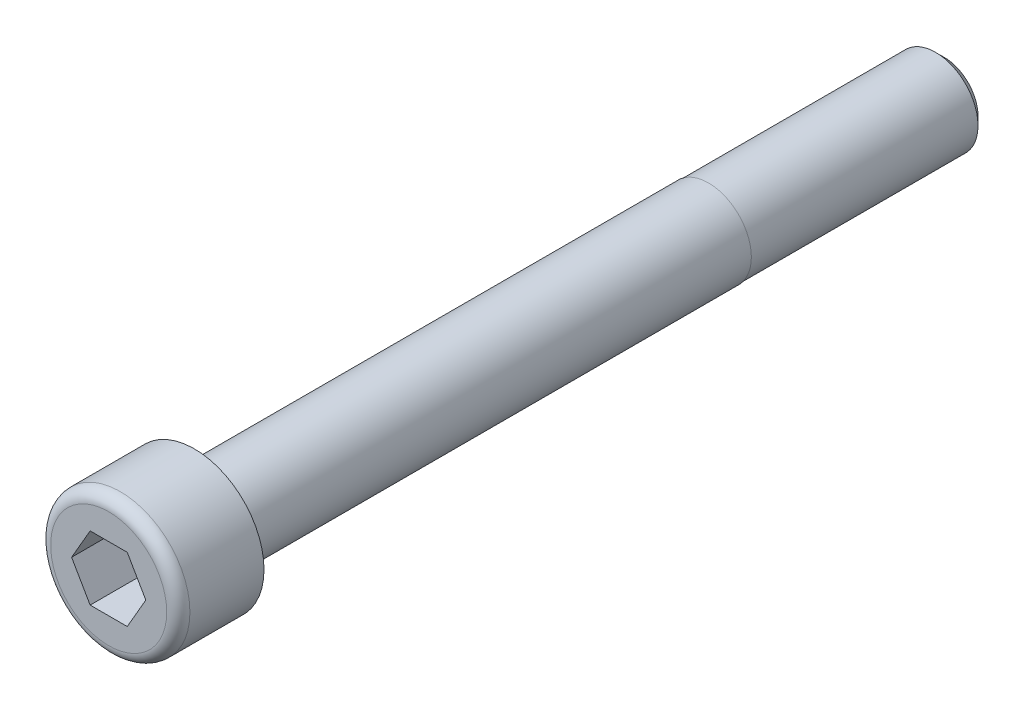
ISO-10303-21;
HEADER;
FILE_DESCRIPTION(('STEP AP214'),'2;1');
FILE_NAME('part.step','',(''),(''),'','','');
FILE_SCHEMA(('AUTOMOTIVE_DESIGN { 1 0 10303 214 1 1 1 1 }'));
ENDSEC;
DATA;
#1=APPLICATION_CONTEXT('core data for automotive mechanical design processes');
#2=APPLICATION_PROTOCOL_DEFINITION('international standard','automotive_design',2000,#1);
#3=PRODUCT_CONTEXT('',#1,'mechanical');
#4=PRODUCT('Part','Part','',(#3));
#5=PRODUCT_RELATED_PRODUCT_CATEGORY('part','',(#4));
#6=PRODUCT_DEFINITION_FORMATION('','',#4);
#7=PRODUCT_DEFINITION_CONTEXT('part definition',#1,'design');
#8=PRODUCT_DEFINITION('design','',#6,#7);
#9=PRODUCT_DEFINITION_SHAPE('','',#8);
#10=(LENGTH_UNIT() NAMED_UNIT(*) SI_UNIT(.MILLI.,.METRE.));
#11=(NAMED_UNIT(*) PLANE_ANGLE_UNIT() SI_UNIT($,.RADIAN.));
#12=(NAMED_UNIT(*) SI_UNIT($,.STERADIAN.) SOLID_ANGLE_UNIT());
#13=UNCERTAINTY_MEASURE_WITH_UNIT(LENGTH_MEASURE(1.E-05),#10,'distance_accuracy_value','');
#14=(GEOMETRIC_REPRESENTATION_CONTEXT(3) GLOBAL_UNCERTAINTY_ASSIGNED_CONTEXT((#13)) GLOBAL_UNIT_ASSIGNED_CONTEXT((#10,
#11,#12)) REPRESENTATION_CONTEXT('',''));
#15=CARTESIAN_POINT('',(0.,0.,0.));
#16=DIRECTION('',(0.,0.,1.));
#17=DIRECTION('',(1.,0.,0.));
#18=AXIS2_PLACEMENT_3D('',#15,#16,#17);
#19=CARTESIAN_POINT('',(0.,0.,-48.));
#20=DIRECTION('',(0.,0.,-1.));
#21=DIRECTION('',(-1.,0.,0.));
#22=AXIS2_PLACEMENT_3D('',#19,#20,#21);
#23=PLANE('',#22);
#24=CARTESIAN_POINT('',(0.,0.,-48.));
#25=DIRECTION('',(0.,0.,-1.));
#26=DIRECTION('',(-1.,0.,0.));
#27=AXIS2_PLACEMENT_3D('',#24,#25,#26);
#28=CIRCLE('',#27,4.);
#29=CARTESIAN_POINT('',(-4.,0.,-48.));
#30=VERTEX_POINT('',#29);
#31=EDGE_CURVE('E135',#30,#30,#28,.T.);
#32=ORIENTED_EDGE('',*,*,#31,.T.);
#33=EDGE_LOOP('',(#32));
#34=FACE_BOUND('',#33,.T.);
#35=CARTESIAN_POINT('',(0.,0.,-48.));
#36=DIRECTION('',(0.,0.,-1.));
#37=DIRECTION('',(-1.,0.,0.));
#38=AXIS2_PLACEMENT_3D('',#35,#36,#37);
#39=CIRCLE('',#38,3.95);
#40=CARTESIAN_POINT('',(-3.95,0.,-48.));
#41=VERTEX_POINT('',#40);
#42=EDGE_CURVE('E122',#41,#41,#39,.T.);
#43=ORIENTED_EDGE('',*,*,#42,.F.);
#44=EDGE_LOOP('',(#43));
#45=FACE_BOUND('',#44,.T.);
#46=ADVANCED_FACE('F32',(#34,#45),#23,.T.);
#47=CARTESIAN_POINT('',(0.,0.,0.));
#48=DIRECTION('',(0.,0.,1.));
#49=DIRECTION('',(1.,0.,0.));
#50=AXIS2_PLACEMENT_3D('',#47,#48,#49);
#51=PLANE('',#50);
#52=CARTESIAN_POINT('',(0.,0.,0.));
#53=DIRECTION('',(0.,0.,1.));
#54=DIRECTION('',(1.,0.,0.));
#55=AXIS2_PLACEMENT_3D('',#52,#53,#54);
#56=CIRCLE('',#55,6.5);
#57=CARTESIAN_POINT('',(6.5,0.,0.));
#58=VERTEX_POINT('',#57);
#59=EDGE_CURVE('E143',#58,#58,#56,.T.);
#60=ORIENTED_EDGE('',*,*,#59,.F.);
#61=EDGE_LOOP('',(#60));
#62=FACE_BOUND('',#61,.T.);
#63=CARTESIAN_POINT('',(0.,0.,0.));
#64=DIRECTION('',(0.,0.,1.));
#65=DIRECTION('',(1.,0.,0.));
#66=AXIS2_PLACEMENT_3D('',#63,#64,#65);
#67=CIRCLE('',#66,4.);
#68=CARTESIAN_POINT('',(4.,0.,0.));
#69=VERTEX_POINT('',#68);
#70=EDGE_CURVE('E146',#69,#69,#67,.F.);
#71=ORIENTED_EDGE('',*,*,#70,.F.);
#72=EDGE_LOOP('',(#71));
#73=FACE_BOUND('',#72,.T.);
#74=ADVANCED_FACE('F170',(#62,#73),#51,.F.);
#75=CARTESIAN_POINT('',(0.,0.,8.));
#76=DIRECTION('',(0.,0.,-1.));
#77=DIRECTION('',(-1.,0.,0.));
#78=AXIS2_PLACEMENT_3D('',#75,#76,#77);
#79=CYLINDRICAL_SURFACE('',#78,6.5);
#80=CARTESIAN_POINT('',(0.,0.,6.91666666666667));
#81=DIRECTION('',(0.,0.,1.));
#82=DIRECTION('',(1.,0.,0.));
#83=AXIS2_PLACEMENT_3D('',#80,#81,#82);
#84=CIRCLE('',#83,6.5);
#85=CARTESIAN_POINT('',(6.5,0.,6.91666666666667));
#86=VERTEX_POINT('',#85);
#87=EDGE_CURVE('E11',#86,#86,#84,.F.);
#88=ORIENTED_EDGE('',*,*,#87,.T.);
#89=EDGE_LOOP('',(#88));
#90=FACE_BOUND('',#89,.T.);
#91=ORIENTED_EDGE('',*,*,#59,.T.);
#92=EDGE_LOOP('',(#91));
#93=FACE_BOUND('',#92,.T.);
#94=ADVANCED_FACE('F176',(#90,#93),#79,.T.);
#95=CARTESIAN_POINT('',(0.,0.,8.));
#96=DIRECTION('',(0.,0.,1.));
#97=DIRECTION('',(1.,0.,0.));
#98=AXIS2_PLACEMENT_3D('',#95,#96,#97);
#99=PLANE('',#98);
#100=CARTESIAN_POINT('',(0.,0.,8.));
#101=DIRECTION('',(0.,0.,1.));
#102=DIRECTION('',(1.,0.,0.));
#103=AXIS2_PLACEMENT_3D('',#100,#101,#102);
#104=CIRCLE('',#103,5.41666666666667);
#105=CARTESIAN_POINT('',(5.41666666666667,0.,8.));
#106=VERTEX_POINT('',#105);
#107=EDGE_CURVE('E40',#106,#106,#104,.T.);
#108=ORIENTED_EDGE('',*,*,#107,.T.);
#109=EDGE_LOOP('',(#108));
#110=FACE_BOUND('',#109,.T.);
#111=DIRECTION('',(0.500000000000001,0.866025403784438,0.));
#112=VECTOR('',#111,1.);
#113=CARTESIAN_POINT('',(1.73205080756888,-2.99999999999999,8.));
#114=LINE('',#113,#112);
#115=CARTESIAN_POINT('',(1.73205080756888,-2.99999999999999,8.));
#116=VERTEX_POINT('',#115);
#117=CARTESIAN_POINT('',(3.46410161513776,0.,8.));
#118=VERTEX_POINT('',#117);
#119=EDGE_CURVE('E47',#116,#118,#114,.T.);
#120=ORIENTED_EDGE('',*,*,#119,.F.);
#121=DIRECTION('',(1.,0.,0.));
#122=VECTOR('',#121,1.);
#123=CARTESIAN_POINT('',(-1.73205080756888,-2.99999999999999,8.));
#124=LINE('',#123,#122);
#125=CARTESIAN_POINT('',(-1.73205080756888,-2.99999999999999,8.));
#126=VERTEX_POINT('',#125);
#127=EDGE_CURVE('E131',#126,#116,#124,.T.);
#128=ORIENTED_EDGE('',*,*,#127,.F.);
#129=DIRECTION('',(0.500000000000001,-0.866025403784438,0.));
#130=VECTOR('',#129,1.);
#131=CARTESIAN_POINT('',(-3.46410161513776,0.,8.));
#132=LINE('',#131,#130);
#133=CARTESIAN_POINT('',(-3.46410161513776,0.,8.));
#134=VERTEX_POINT('',#133);
#135=EDGE_CURVE('E129',#134,#126,#132,.T.);
#136=ORIENTED_EDGE('',*,*,#135,.F.);
#137=DIRECTION('',(-0.500000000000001,-0.866025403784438,0.));
#138=VECTOR('',#137,1.);
#139=CARTESIAN_POINT('',(-1.73205080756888,3.,8.));
#140=LINE('',#139,#138);
#141=CARTESIAN_POINT('',(-1.73205080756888,3.,8.));
#142=VERTEX_POINT('',#141);
#143=EDGE_CURVE('E95',#142,#134,#140,.T.);
#144=ORIENTED_EDGE('',*,*,#143,.F.);
#145=DIRECTION('',(-1.,0.,0.));
#146=VECTOR('',#145,1.);
#147=CARTESIAN_POINT('',(1.73205080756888,3.,8.));
#148=LINE('',#147,#146);
#149=CARTESIAN_POINT('',(1.73205080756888,3.,8.));
#150=VERTEX_POINT('',#149);
#151=EDGE_CURVE('E125',#150,#142,#148,.T.);
#152=ORIENTED_EDGE('',*,*,#151,.F.);
#153=DIRECTION('',(-0.500000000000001,0.866025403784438,0.));
#154=VECTOR('',#153,1.);
#155=CARTESIAN_POINT('',(3.46410161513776,0.,8.));
#156=LINE('',#155,#154);
#157=EDGE_CURVE('E121',#118,#150,#156,.T.);
#158=ORIENTED_EDGE('',*,*,#157,.F.);
#159=EDGE_LOOP('',(#120,#128,#136,#144,#152,#158));
#160=FACE_BOUND('',#159,.T.);
#161=ADVANCED_FACE('F157',(#110,#160),#99,.T.);
#162=CARTESIAN_POINT('',(0.,0.,-48.));
#163=DIRECTION('',(0.,0.,1.));
#164=DIRECTION('',(1.,0.,0.));
#165=AXIS2_PLACEMENT_3D('',#162,#163,#164);
#166=CYLINDRICAL_SURFACE('',#165,4.);
#167=ORIENTED_EDGE('',*,*,#31,.F.);
#168=EDGE_LOOP('',(#167));
#169=FACE_BOUND('',#168,.T.);
#170=ORIENTED_EDGE('',*,*,#70,.T.);
#171=EDGE_LOOP('',(#170));
#172=FACE_BOUND('',#171,.T.);
#173=ADVANCED_FACE('F184',(#169,#172),#166,.T.);
#174=CARTESIAN_POINT('',(1.73205080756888,-2.99999999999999,0.));
#175=DIRECTION('',(0.866025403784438,-0.500000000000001,0.));
#176=DIRECTION('',(0.500000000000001,0.866025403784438,0.));
#177=AXIS2_PLACEMENT_3D('',#174,#175,#176);
#178=PLANE('',#177);
#179=ORIENTED_EDGE('',*,*,#119,.T.);
#180=DIRECTION('',(0.,0.,1.));
#181=VECTOR('',#180,1.);
#182=CARTESIAN_POINT('',(3.46410161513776,0.,0.));
#183=LINE('',#182,#181);
#184=CARTESIAN_POINT('',(3.46410161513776,0.,0.));
#185=VERTEX_POINT('',#184);
#186=EDGE_CURVE('E77',#185,#118,#183,.T.);
#187=ORIENTED_EDGE('',*,*,#186,.F.);
#188=DIRECTION('',(0.500000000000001,0.866025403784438,0.));
#189=VECTOR('',#188,1.);
#190=CARTESIAN_POINT('',(1.73205080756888,-2.99999999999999,0.));
#191=LINE('',#190,#189);
#192=CARTESIAN_POINT('',(1.73205080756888,-2.99999999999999,0.));
#193=VERTEX_POINT('',#192);
#194=EDGE_CURVE('E133',#193,#185,#191,.T.);
#195=ORIENTED_EDGE('',*,*,#194,.F.);
#196=DIRECTION('',(0.,0.,1.));
#197=VECTOR('',#196,1.);
#198=CARTESIAN_POINT('',(1.73205080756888,-2.99999999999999,0.));
#199=LINE('',#198,#197);
#200=EDGE_CURVE('E55',#193,#116,#199,.T.);
#201=ORIENTED_EDGE('',*,*,#200,.T.);
#202=EDGE_LOOP('',(#179,#187,#195,#201));
#203=FACE_BOUND('',#202,.T.);
#204=ADVANCED_FACE('F182',(#203),#178,.F.);
#205=CARTESIAN_POINT('',(-1.73205080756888,-2.99999999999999,0.));
#206=DIRECTION('',(0.,-1.,0.));
#207=DIRECTION('',(0.,0.,-1.));
#208=AXIS2_PLACEMENT_3D('',#205,#206,#207);
#209=PLANE('',#208);
#210=ORIENTED_EDGE('',*,*,#127,.T.);
#211=ORIENTED_EDGE('',*,*,#200,.F.);
#212=DIRECTION('',(1.,0.,0.));
#213=VECTOR('',#212,1.);
#214=CARTESIAN_POINT('',(-1.73205080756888,-2.99999999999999,0.));
#215=LINE('',#214,#213);
#216=CARTESIAN_POINT('',(-1.73205080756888,-2.99999999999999,0.));
#217=VERTEX_POINT('',#216);
#218=EDGE_CURVE('E107',#217,#193,#215,.T.);
#219=ORIENTED_EDGE('',*,*,#218,.F.);
#220=DIRECTION('',(0.,0.,1.));
#221=VECTOR('',#220,1.);
#222=CARTESIAN_POINT('',(-1.73205080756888,-2.99999999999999,0.));
#223=LINE('',#222,#221);
#224=EDGE_CURVE('E99',#217,#126,#223,.T.);
#225=ORIENTED_EDGE('',*,*,#224,.T.);
#226=EDGE_LOOP('',(#210,#211,#219,#225));
#227=FACE_BOUND('',#226,.T.);
#228=ADVANCED_FACE('F216',(#227),#209,.F.);
#229=CARTESIAN_POINT('',(-3.46410161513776,0.,0.));
#230=DIRECTION('',(-0.866025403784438,-0.500000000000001,0.));
#231=DIRECTION('',(0.500000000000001,-0.866025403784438,0.));
#232=AXIS2_PLACEMENT_3D('',#229,#230,#231);
#233=PLANE('',#232);
#234=ORIENTED_EDGE('',*,*,#135,.T.);
#235=ORIENTED_EDGE('',*,*,#224,.F.);
#236=DIRECTION('',(0.500000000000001,-0.866025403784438,0.));
#237=VECTOR('',#236,1.);
#238=CARTESIAN_POINT('',(-3.46410161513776,0.,0.));
#239=LINE('',#238,#237);
#240=CARTESIAN_POINT('',(-3.46410161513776,0.,0.));
#241=VERTEX_POINT('',#240);
#242=EDGE_CURVE('E103',#241,#217,#239,.T.);
#243=ORIENTED_EDGE('',*,*,#242,.F.);
#244=DIRECTION('',(0.,0.,1.));
#245=VECTOR('',#244,1.);
#246=CARTESIAN_POINT('',(-3.46410161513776,0.,0.));
#247=LINE('',#246,#245);
#248=EDGE_CURVE('E88',#241,#134,#247,.T.);
#249=ORIENTED_EDGE('',*,*,#248,.T.);
#250=EDGE_LOOP('',(#234,#235,#243,#249));
#251=FACE_BOUND('',#250,.T.);
#252=ADVANCED_FACE('F104',(#251),#233,.F.);
#253=CARTESIAN_POINT('',(-1.73205080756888,3.,0.));
#254=DIRECTION('',(-0.866025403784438,0.500000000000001,0.));
#255=DIRECTION('',(-0.500000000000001,-0.866025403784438,0.));
#256=AXIS2_PLACEMENT_3D('',#253,#254,#255);
#257=PLANE('',#256);
#258=ORIENTED_EDGE('',*,*,#143,.T.);
#259=ORIENTED_EDGE('',*,*,#248,.F.);
#260=DIRECTION('',(-0.500000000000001,-0.866025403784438,0.));
#261=VECTOR('',#260,1.);
#262=CARTESIAN_POINT('',(-1.73205080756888,3.,0.));
#263=LINE('',#262,#261);
#264=CARTESIAN_POINT('',(-1.73205080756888,3.,0.));
#265=VERTEX_POINT('',#264);
#266=EDGE_CURVE('E92',#265,#241,#263,.T.);
#267=ORIENTED_EDGE('',*,*,#266,.F.);
#268=DIRECTION('',(0.,0.,1.));
#269=VECTOR('',#268,1.);
#270=CARTESIAN_POINT('',(-1.73205080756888,3.,0.));
#271=LINE('',#270,#269);
#272=EDGE_CURVE('E100',#265,#142,#271,.T.);
#273=ORIENTED_EDGE('',*,*,#272,.T.);
#274=EDGE_LOOP('',(#258,#259,#267,#273));
#275=FACE_BOUND('',#274,.T.);
#276=ADVANCED_FACE('F90',(#275),#257,.F.);
#277=CARTESIAN_POINT('',(1.73205080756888,3.,0.));
#278=DIRECTION('',(0.,1.,0.));
#279=DIRECTION('',(0.,0.,1.));
#280=AXIS2_PLACEMENT_3D('',#277,#278,#279);
#281=PLANE('',#280);
#282=ORIENTED_EDGE('',*,*,#151,.T.);
#283=ORIENTED_EDGE('',*,*,#272,.F.);
#284=DIRECTION('',(-1.,0.,0.));
#285=VECTOR('',#284,1.);
#286=CARTESIAN_POINT('',(1.73205080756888,3.,0.));
#287=LINE('',#286,#285);
#288=CARTESIAN_POINT('',(1.73205080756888,3.,0.));
#289=VERTEX_POINT('',#288);
#290=EDGE_CURVE('E113',#289,#265,#287,.T.);
#291=ORIENTED_EDGE('',*,*,#290,.F.);
#292=DIRECTION('',(0.,0.,1.));
#293=VECTOR('',#292,1.);
#294=CARTESIAN_POINT('',(1.73205080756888,3.,0.));
#295=LINE('',#294,#293);
#296=EDGE_CURVE('E138',#289,#150,#295,.T.);
#297=ORIENTED_EDGE('',*,*,#296,.T.);
#298=EDGE_LOOP('',(#282,#283,#291,#297));
#299=FACE_BOUND('',#298,.T.);
#300=ADVANCED_FACE('F234',(#299),#281,.F.);
#301=CARTESIAN_POINT('',(3.46410161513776,0.,0.));
#302=DIRECTION('',(0.866025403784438,0.500000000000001,0.));
#303=DIRECTION('',(-0.500000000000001,0.866025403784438,0.));
#304=AXIS2_PLACEMENT_3D('',#301,#302,#303);
#305=PLANE('',#304);
#306=ORIENTED_EDGE('',*,*,#157,.T.);
#307=ORIENTED_EDGE('',*,*,#296,.F.);
#308=DIRECTION('',(-0.500000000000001,0.866025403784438,0.));
#309=VECTOR('',#308,1.);
#310=CARTESIAN_POINT('',(3.46410161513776,0.,0.));
#311=LINE('',#310,#309);
#312=EDGE_CURVE('E115',#185,#289,#311,.T.);
#313=ORIENTED_EDGE('',*,*,#312,.F.);
#314=ORIENTED_EDGE('',*,*,#186,.T.);
#315=EDGE_LOOP('',(#306,#307,#313,#314));
#316=FACE_BOUND('',#315,.T.);
#317=ADVANCED_FACE('F241',(#316),#305,.F.);
#318=CARTESIAN_POINT('',(3.46410161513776,0.,0.));
#319=DIRECTION('',(0.,0.,1.));
#320=DIRECTION('',(1.,0.,0.));
#321=AXIS2_PLACEMENT_3D('',#318,#319,#320);
#322=PLANE('',#321);
#323=ORIENTED_EDGE('',*,*,#194,.T.);
#324=ORIENTED_EDGE('',*,*,#312,.T.);
#325=ORIENTED_EDGE('',*,*,#290,.T.);
#326=ORIENTED_EDGE('',*,*,#266,.T.);
#327=ORIENTED_EDGE('',*,*,#242,.T.);
#328=ORIENTED_EDGE('',*,*,#218,.T.);
#329=EDGE_LOOP('',(#323,#324,#325,#326,#327,#328));
#330=FACE_BOUND('',#329,.T.);
#331=ADVANCED_FACE('F110',(#330),#322,.T.);
#332=CARTESIAN_POINT('',(0.,0.,-70.));
#333=DIRECTION('',(0.,0.,1.));
#334=DIRECTION('',(1.,0.,0.));
#335=AXIS2_PLACEMENT_3D('',#332,#333,#334);
#336=CYLINDRICAL_SURFACE('',#335,3.95);
#337=CARTESIAN_POINT('',(0.,0.,-69.21));
#338=DIRECTION('',(0.,0.,-1.));
#339=DIRECTION('',(-1.,0.,0.));
#340=AXIS2_PLACEMENT_3D('',#337,#338,#339);
#341=CIRCLE('',#340,3.95);
#342=CARTESIAN_POINT('',(3.95000000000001,0.,-69.21));
#343=VERTEX_POINT('',#342);
#344=EDGE_CURVE('E152',#343,#343,#341,.F.);
#345=ORIENTED_EDGE('',*,*,#344,.T.);
#346=EDGE_LOOP('',(#345));
#347=FACE_BOUND('',#346,.T.);
#348=ORIENTED_EDGE('',*,*,#42,.T.);
#349=EDGE_LOOP('',(#348));
#350=FACE_BOUND('',#349,.T.);
#351=ADVANCED_FACE('F255',(#347,#350),#336,.T.);
#352=CARTESIAN_POINT('',(0.,0.,-70.));
#353=DIRECTION('',(0.,0.,-1.));
#354=DIRECTION('',(-1.,0.,0.));
#355=AXIS2_PLACEMENT_3D('',#352,#353,#354);
#356=PLANE('',#355);
#357=CARTESIAN_POINT('',(0.,0.,-70.));
#358=DIRECTION('',(0.,0.,-1.));
#359=DIRECTION('',(-1.,0.,0.));
#360=AXIS2_PLACEMENT_3D('',#357,#358,#359);
#361=CIRCLE('',#360,3.15999999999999);
#362=CARTESIAN_POINT('',(3.15999999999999,0.,-70.));
#363=VERTEX_POINT('',#362);
#364=EDGE_CURVE('E149',#363,#363,#361,.T.);
#365=ORIENTED_EDGE('',*,*,#364,.T.);
#366=EDGE_LOOP('',(#365));
#367=FACE_BOUND('',#366,.T.);
#368=ADVANCED_FACE('F166',(#367),#356,.T.);
#369=CARTESIAN_POINT('',(0.,0.,-70.));
#370=DIRECTION('',(0.,0.,1.));
#371=DIRECTION('',(1.,0.,0.));
#372=AXIS2_PLACEMENT_3D('',#369,#370,#371);
#373=CONICAL_SURFACE('',#372,3.15999999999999,0.785398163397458);
#374=CARTESIAN_POINT('',(3.95000000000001,0.,-69.21));
#375=CARTESIAN_POINT('',(3.94177083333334,0.,-69.2182291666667));
#376=CARTESIAN_POINT('',(3.93354166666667,0.,-69.2264583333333));
#377=CARTESIAN_POINT('',(3.91708333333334,0.,-69.2429166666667));
#378=CARTESIAN_POINT('',(3.90885416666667,0.,-69.2511458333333));
#379=CARTESIAN_POINT('',(3.89239583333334,0.,-69.2676041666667));
#380=CARTESIAN_POINT('',(3.88416666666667,0.,-69.2758333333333));
#381=CARTESIAN_POINT('',(3.86770833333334,0.,-69.2922916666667));
#382=CARTESIAN_POINT('',(3.85947916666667,0.,-69.3005208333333));
#383=CARTESIAN_POINT('',(3.84302083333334,0.,-69.3169791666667));
#384=CARTESIAN_POINT('',(3.83479166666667,0.,-69.3252083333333));
#385=CARTESIAN_POINT('',(3.81833333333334,0.,-69.3416666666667));
#386=CARTESIAN_POINT('',(3.81010416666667,0.,-69.3498958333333));
#387=CARTESIAN_POINT('',(3.79364583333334,0.,-69.3663541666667));
#388=CARTESIAN_POINT('',(3.78541666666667,0.,-69.3745833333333));
#389=CARTESIAN_POINT('',(3.76895833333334,0.,-69.3910416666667));
#390=CARTESIAN_POINT('',(3.76072916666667,0.,-69.3992708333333));
#391=CARTESIAN_POINT('',(3.74427083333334,0.,-69.4157291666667));
#392=CARTESIAN_POINT('',(3.73604166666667,0.,-69.4239583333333));
#393=CARTESIAN_POINT('',(3.71958333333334,0.,-69.4404166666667));
#394=CARTESIAN_POINT('',(3.71135416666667,0.,-69.4486458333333));
#395=CARTESIAN_POINT('',(3.69489583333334,0.,-69.4651041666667));
#396=CARTESIAN_POINT('',(3.68666666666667,0.,-69.4733333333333));
#397=CARTESIAN_POINT('',(3.67020833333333,0.,-69.4897916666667));
#398=CARTESIAN_POINT('',(3.66197916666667,0.,-69.4980208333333));
#399=CARTESIAN_POINT('',(3.64552083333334,0.,-69.5144791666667));
#400=CARTESIAN_POINT('',(3.63729166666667,0.,-69.5227083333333));
#401=CARTESIAN_POINT('',(3.62083333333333,0.,-69.5391666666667));
#402=CARTESIAN_POINT('',(3.61260416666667,0.,-69.5473958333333));
#403=CARTESIAN_POINT('',(3.59614583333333,0.,-69.5638541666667));
#404=CARTESIAN_POINT('',(3.58791666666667,0.,-69.5720833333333));
#405=CARTESIAN_POINT('',(3.57145833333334,0.,-69.5885416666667));
#406=CARTESIAN_POINT('',(3.56322916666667,0.,-69.5967708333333));
#407=CARTESIAN_POINT('',(3.54677083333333,0.,-69.6132291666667));
#408=CARTESIAN_POINT('',(3.53854166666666,0.,-69.6214583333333));
#409=CARTESIAN_POINT('',(3.52208333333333,0.,-69.6379166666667));
#410=CARTESIAN_POINT('',(3.51385416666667,0.,-69.6461458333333));
#411=CARTESIAN_POINT('',(3.49739583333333,0.,-69.6626041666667));
#412=CARTESIAN_POINT('',(3.48916666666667,0.,-69.6708333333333));
#413=CARTESIAN_POINT('',(3.47270833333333,0.,-69.6872916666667));
#414=CARTESIAN_POINT('',(3.46447916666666,0.,-69.6955208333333));
#415=CARTESIAN_POINT('',(3.44802083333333,0.,-69.7119791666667));
#416=CARTESIAN_POINT('',(3.43979166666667,0.,-69.7202083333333));
#417=CARTESIAN_POINT('',(3.42333333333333,0.,-69.7366666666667));
#418=CARTESIAN_POINT('',(3.41510416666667,0.,-69.7448958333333));
#419=CARTESIAN_POINT('',(3.39864583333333,0.,-69.7613541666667));
#420=CARTESIAN_POINT('',(3.39041666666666,0.,-69.7695833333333));
#421=CARTESIAN_POINT('',(3.37395833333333,0.,-69.7860416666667));
#422=CARTESIAN_POINT('',(3.36572916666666,0.,-69.7942708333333));
#423=CARTESIAN_POINT('',(3.34927083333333,0.,-69.8107291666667));
#424=CARTESIAN_POINT('',(3.34104166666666,0.,-69.8189583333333));
#425=CARTESIAN_POINT('',(3.32458333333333,0.,-69.8354166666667));
#426=CARTESIAN_POINT('',(3.31635416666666,0.,-69.8436458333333));
#427=CARTESIAN_POINT('',(3.29989583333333,0.,-69.8601041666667));
#428=CARTESIAN_POINT('',(3.29166666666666,0.,-69.8683333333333));
#429=CARTESIAN_POINT('',(3.27520833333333,0.,-69.8847916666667));
#430=CARTESIAN_POINT('',(3.26697916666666,0.,-69.8930208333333));
#431=CARTESIAN_POINT('',(3.25052083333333,0.,-69.9094791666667));
#432=CARTESIAN_POINT('',(3.24229166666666,0.,-69.9177083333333));
#433=CARTESIAN_POINT('',(3.22583333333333,0.,-69.9341666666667));
#434=CARTESIAN_POINT('',(3.21760416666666,0.,-69.9423958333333));
#435=CARTESIAN_POINT('',(3.20114583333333,0.,-69.9588541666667));
#436=CARTESIAN_POINT('',(3.19291666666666,0.,-69.9670833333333));
#437=CARTESIAN_POINT('',(3.17645833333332,0.,-69.9835416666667));
#438=CARTESIAN_POINT('',(3.16822916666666,0.,-69.9917708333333));
#439=CARTESIAN_POINT('',(3.15999999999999,0.,-70.));
#440=B_SPLINE_CURVE_WITH_KNOTS('',3,(#374,#375,#376,#377,#378,#379,#380,#381,#382,#383,#384,
#385,#386,#387,#388,#389,#390,#391,#392,#393,#394,#395,#396,#397,#398,#399,#400,#401,#402,#403,
#404,#405,#406,#407,#408,#409,#410,#411,#412,#413,#414,#415,#416,#417,#418,#419,#420,#421,#422,
#423,#424,#425,#426,#427,#428,#429,#430,#431,#432,#433,#434,#435,#436,#437,#438,#439),
.UNSPECIFIED.,.F.,.F.,(4,2,2,2,2,2,2,2,2,2,2,2,2,2,2,2,2,2,2,2,2,2,2,2,2,2,2,2,2,2,2,2,4),(0.,
0.0349133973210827,0.0698267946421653,0.104740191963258,0.139653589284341,0.174566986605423,
0.209480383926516,0.244393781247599,0.279307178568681,0.314220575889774,0.349133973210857,
0.384047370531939,0.418960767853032,0.453874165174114,0.488787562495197,0.52370095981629,
0.558614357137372,0.593527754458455,0.628441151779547,0.66335454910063,0.698267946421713,
0.733181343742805,0.768094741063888,0.803008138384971,0.837921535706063,0.872834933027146,
0.907748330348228,0.942661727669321,0.977575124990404,1.01248852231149,1.04740191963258,
1.08231531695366,1.11722871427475),.UNSPECIFIED.);
#441=EDGE_CURVE('BSEAM161',#343,#363,#440,.T.);
#442=ORIENTED_EDGE('',*,*,#344,.F.);
#443=ORIENTED_EDGE('',*,*,#364,.F.);
#444=ORIENTED_EDGE('',*,*,#441,.T.);
#445=ORIENTED_EDGE('',*,*,#441,.F.);
#446=EDGE_LOOP('',(#442,#444,#443,#445));
#447=FACE_BOUND('',#446,.T.);
#448=ADVANCED_FACE('F161',(#447),#373,.T.);
#449=CARTESIAN_POINT('',(0.,0.,6.91666666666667));
#450=DIRECTION('',(0.,0.,1.));
#451=DIRECTION('',(1.,0.,0.));
#452=AXIS2_PLACEMENT_3D('',#449,#450,#451);
#453=TOROIDAL_SURFACE('',#452,5.41666666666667,1.08333333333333);
#454=ORIENTED_EDGE('',*,*,#87,.F.);
#455=EDGE_LOOP('',(#454));
#456=FACE_BOUND('',#455,.T.);
#457=ORIENTED_EDGE('',*,*,#107,.F.);
#458=EDGE_LOOP('',(#457));
#459=FACE_BOUND('',#458,.T.);
#460=ADVANCED_FACE('F34',(#456,#459),#453,.T.);
#461=CLOSED_SHELL('',(#46,#74,#94,#161,#173,#204,#228,#252,#276,#300,#317,#331,#351,#368,#448,#460));
#462=MANIFOLD_SOLID_BREP('B2',#461);
#463=ADVANCED_BREP_SHAPE_REPRESENTATION('',(#18,#462),#14);
#464=SHAPE_DEFINITION_REPRESENTATION(#9,#463);
ENDSEC;
END-ISO-10303-21;
